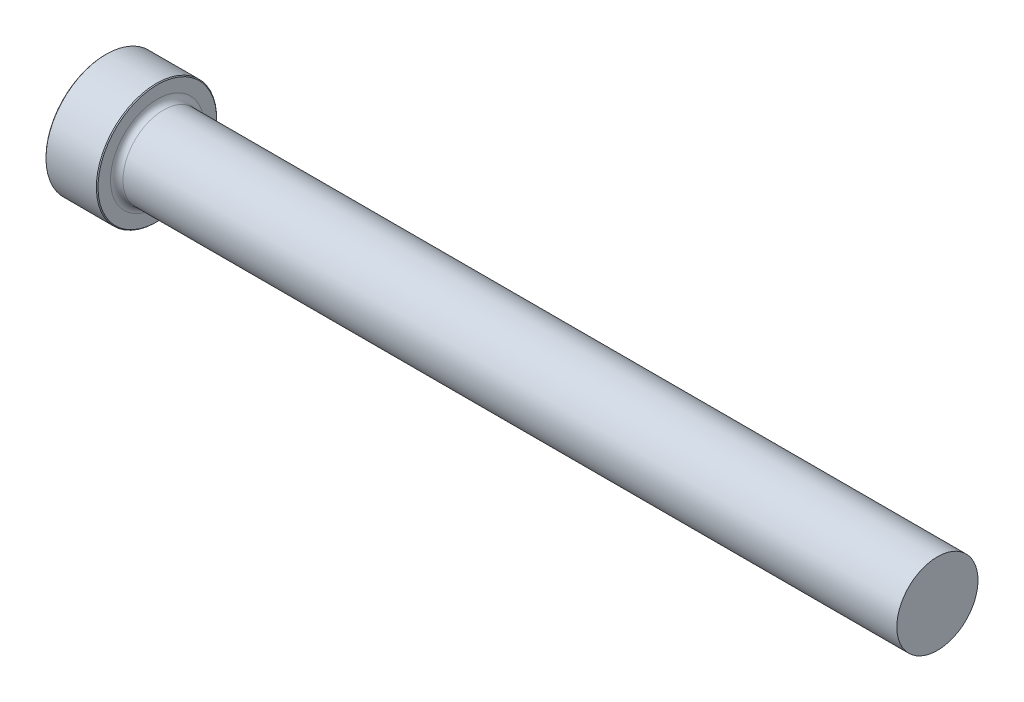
ISO-10303-21;
HEADER;
FILE_DESCRIPTION(('STEP AP214'),'2;1');
FILE_NAME('part.step','',(''),(''),'','','');
FILE_SCHEMA(('AUTOMOTIVE_DESIGN { 1 0 10303 214 1 1 1 1 }'));
ENDSEC;
DATA;
#1=APPLICATION_CONTEXT('core data for automotive mechanical design processes');
#2=APPLICATION_PROTOCOL_DEFINITION('international standard','automotive_design',2000,#1);
#3=PRODUCT_CONTEXT('',#1,'mechanical');
#4=PRODUCT('Part','Part','',(#3));
#5=PRODUCT_RELATED_PRODUCT_CATEGORY('part','',(#4));
#6=PRODUCT_DEFINITION_FORMATION('','',#4);
#7=PRODUCT_DEFINITION_CONTEXT('part definition',#1,'design');
#8=PRODUCT_DEFINITION('design','',#6,#7);
#9=PRODUCT_DEFINITION_SHAPE('','',#8);
#10=(LENGTH_UNIT() NAMED_UNIT(*) SI_UNIT(.MILLI.,.METRE.));
#11=(NAMED_UNIT(*) PLANE_ANGLE_UNIT() SI_UNIT($,.RADIAN.));
#12=(NAMED_UNIT(*) SI_UNIT($,.STERADIAN.) SOLID_ANGLE_UNIT());
#13=UNCERTAINTY_MEASURE_WITH_UNIT(LENGTH_MEASURE(1.E-05),#10,'distance_accuracy_value','');
#14=(GEOMETRIC_REPRESENTATION_CONTEXT(3) GLOBAL_UNCERTAINTY_ASSIGNED_CONTEXT((#13)) GLOBAL_UNIT_ASSIGNED_CONTEXT((#10,
#11,#12)) REPRESENTATION_CONTEXT('',''));
#15=CARTESIAN_POINT('',(0.,0.,0.));
#16=DIRECTION('',(0.,0.,1.));
#17=DIRECTION('',(1.,0.,0.));
#18=AXIS2_PLACEMENT_3D('',#15,#16,#17);
#19=CARTESIAN_POINT('',(101.6,4.95712749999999,0.));
#20=DIRECTION('',(1.,0.,0.));
#21=DIRECTION('',(0.,1.,0.));
#22=AXIS2_PLACEMENT_3D('',#19,#20,#21);
#23=PLANE('',#22);
#24=CARTESIAN_POINT('',(101.6,0.,0.));
#25=DIRECTION('',(1.,0.,0.));
#26=DIRECTION('',(0.,1.,0.));
#27=AXIS2_PLACEMENT_3D('',#24,#25,#26);
#28=CIRCLE('',#27,4.9571275);
#29=CARTESIAN_POINT('',(101.6,4.95712749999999,0.));
#30=VERTEX_POINT('',#29);
#31=EDGE_CURVE('E50',#30,#30,#28,.T.);
#32=ORIENTED_EDGE('',*,*,#31,.T.);
#33=EDGE_LOOP('',(#32));
#34=FACE_BOUND('',#33,.T.);
#35=ADVANCED_FACE('F30',(#34),#23,.T.);
#36=CARTESIAN_POINT('',(101.6,0.,0.));
#37=DIRECTION('',(1.,0.,0.));
#38=DIRECTION('',(0.,1.,0.));
#39=AXIS2_PLACEMENT_3D('',#36,#37,#38);
#40=CYLINDRICAL_SURFACE('',#39,4.9571275);
#41=CARTESIAN_POINT('',(7.11199999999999,0.,0.));
#42=DIRECTION('',(1.,0.,0.));
#43=DIRECTION('',(0.,1.,0.));
#44=AXIS2_PLACEMENT_3D('',#41,#42,#43);
#45=CIRCLE('',#44,4.95712749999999);
#46=CARTESIAN_POINT('',(7.11199999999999,4.95712749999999,0.));
#47=VERTEX_POINT('',#46);
#48=EDGE_CURVE('E53',#47,#47,#45,.T.);
#49=ORIENTED_EDGE('',*,*,#48,.T.);
#50=EDGE_LOOP('',(#49));
#51=FACE_BOUND('',#50,.T.);
#52=ORIENTED_EDGE('',*,*,#31,.F.);
#53=EDGE_LOOP('',(#52));
#54=FACE_BOUND('',#53,.T.);
#55=ADVANCED_FACE('F74',(#51,#54),#40,.T.);
#56=CARTESIAN_POINT('',(7.112,0.,0.));
#57=DIRECTION('',(1.,0.,0.));
#58=DIRECTION('',(0.,1.,0.));
#59=AXIS2_PLACEMENT_3D('',#56,#57,#58);
#60=TOROIDAL_SURFACE('',#59,5.71912749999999,0.762);
#61=CARTESIAN_POINT('',(6.34999999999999,0.,0.));
#62=DIRECTION('',(1.,0.,0.));
#63=DIRECTION('',(0.,1.,0.));
#64=AXIS2_PLACEMENT_3D('',#61,#62,#63);
#65=CIRCLE('',#64,5.71912749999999);
#66=CARTESIAN_POINT('',(6.34999999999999,5.71912749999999,0.));
#67=VERTEX_POINT('',#66);
#68=EDGE_CURVE('E56',#67,#67,#65,.T.);
#69=ORIENTED_EDGE('',*,*,#68,.T.);
#70=EDGE_LOOP('',(#69));
#71=FACE_BOUND('',#70,.T.);
#72=ORIENTED_EDGE('',*,*,#48,.F.);
#73=EDGE_LOOP('',(#72));
#74=FACE_BOUND('',#73,.T.);
#75=ADVANCED_FACE('F60',(#71,#74),#60,.F.);
#76=CARTESIAN_POINT('',(6.35,7.3421875,0.));
#77=DIRECTION('',(1.,0.,0.));
#78=DIRECTION('',(0.,1.,0.));
#79=AXIS2_PLACEMENT_3D('',#76,#77,#78);
#80=PLANE('',#79);
#81=CARTESIAN_POINT('',(6.35,0.,0.));
#82=DIRECTION('',(1.,0.,0.));
#83=DIRECTION('',(0.,1.,0.));
#84=AXIS2_PLACEMENT_3D('',#81,#82,#83);
#85=CIRCLE('',#84,7.2405875);
#86=CARTESIAN_POINT('',(6.35,7.2405875,0.));
#87=VERTEX_POINT('',#86);
#88=EDGE_CURVE('E10',#87,#87,#85,.T.);
#89=ORIENTED_EDGE('',*,*,#88,.T.);
#90=EDGE_LOOP('',(#89));
#91=FACE_BOUND('',#90,.T.);
#92=ORIENTED_EDGE('',*,*,#68,.F.);
#93=EDGE_LOOP('',(#92));
#94=FACE_BOUND('',#93,.T.);
#95=ADVANCED_FACE('F63',(#91,#94),#80,.T.);
#96=CARTESIAN_POINT('',(101.6,0.,0.));
#97=DIRECTION('',(1.,0.,0.));
#98=DIRECTION('',(0.,1.,0.));
#99=AXIS2_PLACEMENT_3D('',#96,#97,#98);
#100=CYLINDRICAL_SURFACE('',#99,7.3421875);
#101=CARTESIAN_POINT('',(0.101599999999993,0.,0.));
#102=DIRECTION('',(-1.,0.,0.));
#103=DIRECTION('',(0.,-1.,0.));
#104=AXIS2_PLACEMENT_3D('',#101,#102,#103);
#105=CIRCLE('',#104,7.3421875);
#106=CARTESIAN_POINT('',(0.101599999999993,-7.3421875,0.));
#107=VERTEX_POINT('',#106);
#108=EDGE_CURVE('E41',#107,#107,#105,.F.);
#109=ORIENTED_EDGE('',*,*,#108,.T.);
#110=EDGE_LOOP('',(#109));
#111=FACE_BOUND('',#110,.T.);
#112=CARTESIAN_POINT('',(6.2484,0.,0.));
#113=DIRECTION('',(1.,0.,0.));
#114=DIRECTION('',(0.,1.,0.));
#115=AXIS2_PLACEMENT_3D('',#112,#113,#114);
#116=CIRCLE('',#115,7.3421875);
#117=CARTESIAN_POINT('',(6.2484,7.3421875,0.));
#118=VERTEX_POINT('',#117);
#119=EDGE_CURVE('E45',#118,#118,#116,.F.);
#120=ORIENTED_EDGE('',*,*,#119,.T.);
#121=EDGE_LOOP('',(#120));
#122=FACE_BOUND('',#121,.T.);
#123=ADVANCED_FACE('F65',(#111,#122),#100,.T.);
#124=CARTESIAN_POINT('',(0.,0.,0.));
#125=DIRECTION('',(-1.,0.,0.));
#126=DIRECTION('',(0.,-1.,0.));
#127=AXIS2_PLACEMENT_3D('',#124,#125,#126);
#128=PLANE('',#127);
#129=CARTESIAN_POINT('',(0.,0.,0.));
#130=DIRECTION('',(-1.,0.,0.));
#131=DIRECTION('',(0.,-1.,0.));
#132=AXIS2_PLACEMENT_3D('',#129,#130,#131);
#133=CIRCLE('',#132,7.24058750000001);
#134=CARTESIAN_POINT('',(0.,-7.24058750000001,0.));
#135=VERTEX_POINT('',#134);
#136=EDGE_CURVE('E37',#135,#135,#133,.T.);
#137=ORIENTED_EDGE('',*,*,#136,.T.);
#138=EDGE_LOOP('',(#137));
#139=FACE_BOUND('',#138,.T.);
#140=ADVANCED_FACE('F71',(#139),#128,.T.);
#141=CARTESIAN_POINT('',(0.101599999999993,0.,0.));
#142=DIRECTION('',(1.,0.,0.));
#143=DIRECTION('',(0.,1.,0.));
#144=AXIS2_PLACEMENT_3D('',#141,#142,#143);
#145=CONICAL_SURFACE('',#144,7.3421875,0.785398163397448);
#146=ORIENTED_EDGE('',*,*,#136,.F.);
#147=EDGE_LOOP('',(#146));
#148=FACE_BOUND('',#147,.T.);
#149=ORIENTED_EDGE('',*,*,#108,.F.);
#150=EDGE_LOOP('',(#149));
#151=FACE_BOUND('',#150,.T.);
#152=ADVANCED_FACE('F84',(#148,#151),#145,.T.);
#153=CARTESIAN_POINT('',(6.34999999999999,0.,0.));
#154=DIRECTION('',(-1.,0.,0.));
#155=DIRECTION('',(0.,-1.,0.));
#156=AXIS2_PLACEMENT_3D('',#153,#154,#155);
#157=CONICAL_SURFACE('',#156,7.24058750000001,0.785398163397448);
#158=ORIENTED_EDGE('',*,*,#119,.F.);
#159=EDGE_LOOP('',(#158));
#160=FACE_BOUND('',#159,.T.);
#161=ORIENTED_EDGE('',*,*,#88,.F.);
#162=EDGE_LOOP('',(#161));
#163=FACE_BOUND('',#162,.T.);
#164=ADVANCED_FACE('F32',(#160,#163),#157,.T.);
#165=CLOSED_SHELL('',(#35,#55,#75,#95,#123,#140,#152,#164));
#166=MANIFOLD_SOLID_BREP('B2',#165);
#167=ADVANCED_BREP_SHAPE_REPRESENTATION('',(#18,#166),#14);
#168=SHAPE_DEFINITION_REPRESENTATION(#9,#167);
ENDSEC;
END-ISO-10303-21;
